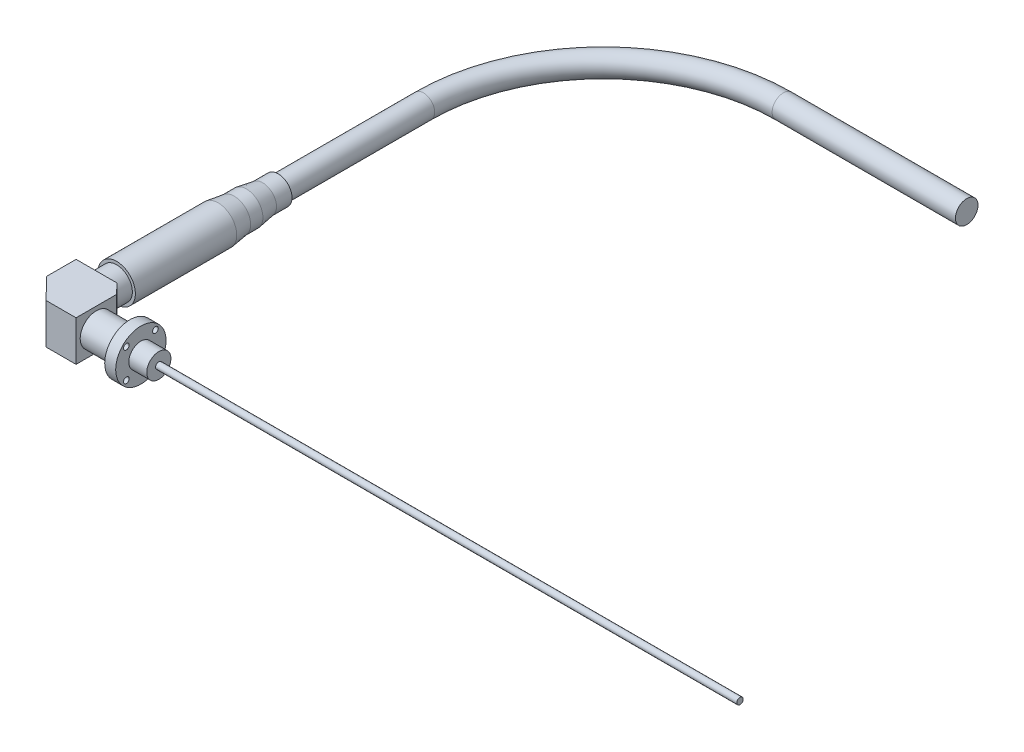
ISO-10303-21;
HEADER;
FILE_DESCRIPTION(('STEP AP214'),'2;1');
FILE_NAME('part.step','',(''),(''),'','','');
FILE_SCHEMA(('AUTOMOTIVE_DESIGN { 1 0 10303 214 1 1 1 1 }'));
ENDSEC;
DATA;
#1=APPLICATION_CONTEXT('core data for automotive mechanical design processes');
#2=APPLICATION_PROTOCOL_DEFINITION('international standard','automotive_design',2000,#1);
#3=PRODUCT_CONTEXT('',#1,'mechanical');
#4=PRODUCT('Part','Part','',(#3));
#5=PRODUCT_RELATED_PRODUCT_CATEGORY('part','',(#4));
#6=PRODUCT_DEFINITION_FORMATION('','',#4);
#7=PRODUCT_DEFINITION_CONTEXT('part definition',#1,'design');
#8=PRODUCT_DEFINITION('design','',#6,#7);
#9=PRODUCT_DEFINITION_SHAPE('','',#8);
#10=(LENGTH_UNIT() NAMED_UNIT(*) SI_UNIT(.MILLI.,.METRE.));
#11=(NAMED_UNIT(*) PLANE_ANGLE_UNIT() SI_UNIT($,.RADIAN.));
#12=(NAMED_UNIT(*) SI_UNIT($,.STERADIAN.) SOLID_ANGLE_UNIT());
#13=UNCERTAINTY_MEASURE_WITH_UNIT(LENGTH_MEASURE(1.E-05),#10,'distance_accuracy_value','');
#14=(GEOMETRIC_REPRESENTATION_CONTEXT(3) GLOBAL_UNCERTAINTY_ASSIGNED_CONTEXT((#13)) GLOBAL_UNIT_ASSIGNED_CONTEXT((#10,
#11,#12)) REPRESENTATION_CONTEXT('',''));
#15=CARTESIAN_POINT('',(0.,0.,0.));
#16=DIRECTION('',(0.,0.,1.));
#17=DIRECTION('',(1.,0.,0.));
#18=AXIS2_PLACEMENT_3D('',#15,#16,#17);
#19=CARTESIAN_POINT('',(72.7964,0.,23.876));
#20=DIRECTION('',(-1.,0.,0.));
#21=DIRECTION('',(0.,0.,1.));
#22=AXIS2_PLACEMENT_3D('',#19,#20,#21);
#23=PLANE('',#22);
#24=CARTESIAN_POINT('',(72.7964,0.,23.876));
#25=DIRECTION('',(-1.,0.,0.));
#26=DIRECTION('',(0.,0.,1.));
#27=AXIS2_PLACEMENT_3D('',#24,#25,#26);
#28=CIRCLE('',#27,9.4996);
#29=CARTESIAN_POINT('',(72.7964,0.,33.3756));
#30=VERTEX_POINT('',#29);
#31=EDGE_CURVE('E457',#30,#30,#28,.T.);
#32=ORIENTED_EDGE('',*,*,#31,.F.);
#33=EDGE_LOOP('',(#32));
#34=FACE_BOUND('',#33,.T.);
#35=CARTESIAN_POINT('',(72.7964,0.,23.876));
#36=DIRECTION('',(-1.,0.,0.));
#37=DIRECTION('',(0.,0.,1.));
#38=AXIS2_PLACEMENT_3D('',#35,#36,#37);
#39=CIRCLE('',#38,2.54);
#40=CARTESIAN_POINT('',(72.7964,0.,26.416));
#41=VERTEX_POINT('',#40);
#42=EDGE_CURVE('E11',#41,#41,#39,.F.);
#43=ORIENTED_EDGE('',*,*,#42,.F.);
#44=EDGE_LOOP('',(#43));
#45=FACE_BOUND('',#44,.T.);
#46=ADVANCED_FACE('F380',(#34,#45),#23,.F.);
#47=CARTESIAN_POINT('',(23.6455461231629,15.875,7.97842349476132));
#48=DIRECTION('',(-1.,0.,0.));
#49=DIRECTION('',(0.,0.,1.));
#50=AXIS2_PLACEMENT_3D('',#47,#48,#49);
#51=PLANE('',#50);
#52=DIRECTION('',(0.,0.,-1.));
#53=VECTOR('',#52,1.);
#54=CARTESIAN_POINT('',(23.6455461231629,-15.875,7.97842349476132));
#55=LINE('',#54,#53);
#56=CARTESIAN_POINT('',(23.6455461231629,-15.875,39.8332355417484));
#57=VERTEX_POINT('',#56);
#58=CARTESIAN_POINT('',(23.6455461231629,-15.875,7.97842349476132));
#59=VERTEX_POINT('',#58);
#60=EDGE_CURVE('E465',#57,#59,#55,.T.);
#61=ORIENTED_EDGE('',*,*,#60,.T.);
#62=DIRECTION('',(0.,-1.,0.));
#63=VECTOR('',#62,1.);
#64=CARTESIAN_POINT('',(23.6455461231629,15.875,7.97842349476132));
#65=LINE('',#64,#63);
#66=CARTESIAN_POINT('',(23.6455461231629,15.875,7.97842349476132));
#67=VERTEX_POINT('',#66);
#68=EDGE_CURVE('E484',#67,#59,#65,.T.);
#69=ORIENTED_EDGE('',*,*,#68,.F.);
#70=DIRECTION('',(0.,0.,-1.));
#71=VECTOR('',#70,1.);
#72=CARTESIAN_POINT('',(23.6455461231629,15.875,7.97842349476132));
#73=LINE('',#72,#71);
#74=CARTESIAN_POINT('',(23.6455461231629,15.875,39.8332355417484));
#75=VERTEX_POINT('',#74);
#76=EDGE_CURVE('E476',#75,#67,#73,.T.);
#77=ORIENTED_EDGE('',*,*,#76,.F.);
#78=DIRECTION('',(0.,-1.,0.));
#79=VECTOR('',#78,1.);
#80=CARTESIAN_POINT('',(23.6455461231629,15.875,39.8332355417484));
#81=LINE('',#80,#79);
#82=EDGE_CURVE('E487',#75,#57,#81,.T.);
#83=ORIENTED_EDGE('',*,*,#82,.T.);
#84=EDGE_LOOP('',(#61,#69,#77,#83));
#85=FACE_BOUND('',#84,.T.);
#86=CARTESIAN_POINT('',(23.6455461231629,0.,23.876));
#87=DIRECTION('',(-1.,0.,0.));
#88=DIRECTION('',(0.,0.,1.));
#89=AXIS2_PLACEMENT_3D('',#86,#87,#88);
#90=CIRCLE('',#89,12.7);
#91=CARTESIAN_POINT('',(23.6455461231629,0.,36.576));
#92=VERTEX_POINT('',#91);
#93=EDGE_CURVE('E388',#92,#92,#90,.F.);
#94=ORIENTED_EDGE('',*,*,#93,.F.);
#95=EDGE_LOOP('',(#94));
#96=FACE_BOUND('',#95,.T.);
#97=ADVANCED_FACE('F530',(#85,#96),#51,.F.);
#98=CARTESIAN_POINT('',(0.,0.,-204.828193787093));
#99=DIRECTION('',(0.,0.,-1.));
#100=DIRECTION('',(-1.,0.,0.));
#101=AXIS2_PLACEMENT_3D('',#98,#99,#100);
#102=CYLINDRICAL_SURFACE('',#101,12.3825);
#103=CARTESIAN_POINT('',(0.,0.,0.));
#104=DIRECTION('',(0.,0.,1.));
#105=DIRECTION('',(1.,0.,0.));
#106=AXIS2_PLACEMENT_3D('',#103,#104,#105);
#107=CIRCLE('',#106,12.3825);
#108=CARTESIAN_POINT('',(12.3825,0.,0.));
#109=VERTEX_POINT('',#108);
#110=EDGE_CURVE('E451',#109,#109,#107,.F.);
#111=ORIENTED_EDGE('',*,*,#110,.T.);
#112=EDGE_LOOP('',(#111));
#113=FACE_BOUND('',#112,.T.);
#114=CARTESIAN_POINT('',(0.,0.,-15.748));
#115=DIRECTION('',(0.,0.,-1.));
#116=DIRECTION('',(-1.,0.,0.));
#117=AXIS2_PLACEMENT_3D('',#114,#115,#116);
#118=CIRCLE('',#117,12.3825);
#119=CARTESIAN_POINT('',(-12.3825,0.,-15.748));
#120=VERTEX_POINT('',#119);
#121=EDGE_CURVE('E497',#120,#120,#118,.T.);
#122=ORIENTED_EDGE('',*,*,#121,.F.);
#123=EDGE_LOOP('',(#122));
#124=FACE_BOUND('',#123,.T.);
#125=ADVANCED_FACE('F382',(#113,#124),#102,.T.);
#126=CARTESIAN_POINT('',(-14.732,0.,-15.748));
#127=DIRECTION('',(0.,0.,1.));
#128=DIRECTION('',(1.,0.,0.));
#129=AXIS2_PLACEMENT_3D('',#126,#127,#128);
#130=PLANE('',#129);
#131=ORIENTED_EDGE('',*,*,#121,.T.);
#132=EDGE_LOOP('',(#131));
#133=FACE_BOUND('',#132,.T.);
#134=CARTESIAN_POINT('',(0.,0.,-15.748));
#135=DIRECTION('',(0.,0.,-1.));
#136=DIRECTION('',(-1.,0.,0.));
#137=AXIS2_PLACEMENT_3D('',#134,#135,#136);
#138=CIRCLE('',#137,14.732);
#139=CARTESIAN_POINT('',(-14.732,0.,-15.748));
#140=VERTEX_POINT('',#139);
#141=EDGE_CURVE('E521',#140,#140,#138,.T.);
#142=ORIENTED_EDGE('',*,*,#141,.F.);
#143=EDGE_LOOP('',(#142));
#144=FACE_BOUND('',#143,.T.);
#145=ADVANCED_FACE('F539',(#133,#144),#130,.T.);
#146=CARTESIAN_POINT('',(0.,0.,-204.828193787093));
#147=DIRECTION('',(0.,0.,-1.));
#148=DIRECTION('',(-1.,0.,0.));
#149=AXIS2_PLACEMENT_3D('',#146,#147,#148);
#150=CYLINDRICAL_SURFACE('',#149,14.732);
#151=ORIENTED_EDGE('',*,*,#141,.T.);
#152=EDGE_LOOP('',(#151));
#153=FACE_BOUND('',#152,.T.);
#154=CARTESIAN_POINT('',(0.,0.,-95.504));
#155=DIRECTION('',(0.,0.,-1.));
#156=DIRECTION('',(-1.,0.,0.));
#157=AXIS2_PLACEMENT_3D('',#154,#155,#156);
#158=CIRCLE('',#157,14.732);
#159=CARTESIAN_POINT('',(-14.732,0.,-95.504));
#160=VERTEX_POINT('',#159);
#161=EDGE_CURVE('E518',#160,#160,#158,.T.);
#162=ORIENTED_EDGE('',*,*,#161,.F.);
#163=EDGE_LOOP('',(#162));
#164=FACE_BOUND('',#163,.T.);
#165=ADVANCED_FACE('F589',(#153,#164),#150,.T.);
#166=CARTESIAN_POINT('',(0.,0.,-108.204));
#167=DIRECTION('',(0.,0.,1.));
#168=DIRECTION('',(1.,0.,0.));
#169=AXIS2_PLACEMENT_3D('',#166,#167,#168);
#170=CONICAL_SURFACE('',#169,12.954,0.13909594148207);
#171=ORIENTED_EDGE('',*,*,#161,.T.);
#172=EDGE_LOOP('',(#171));
#173=FACE_BOUND('',#172,.T.);
#174=CARTESIAN_POINT('',(0.,0.,-108.204));
#175=DIRECTION('',(0.,0.,-1.));
#176=DIRECTION('',(-1.,0.,0.));
#177=AXIS2_PLACEMENT_3D('',#174,#175,#176);
#178=CIRCLE('',#177,12.954);
#179=CARTESIAN_POINT('',(-12.954,0.,-108.204));
#180=VERTEX_POINT('',#179);
#181=EDGE_CURVE('E515',#180,#180,#178,.T.);
#182=ORIENTED_EDGE('',*,*,#181,.F.);
#183=EDGE_LOOP('',(#182));
#184=FACE_BOUND('',#183,.T.);
#185=ADVANCED_FACE('F585',(#173,#184),#170,.T.);
#186=CARTESIAN_POINT('',(0.,0.,-204.828193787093));
#187=DIRECTION('',(0.,0.,-1.));
#188=DIRECTION('',(-1.,0.,0.));
#189=AXIS2_PLACEMENT_3D('',#186,#187,#188);
#190=CYLINDRICAL_SURFACE('',#189,12.954);
#191=ORIENTED_EDGE('',*,*,#181,.T.);
#192=EDGE_LOOP('',(#191));
#193=FACE_BOUND('',#192,.T.);
#194=CARTESIAN_POINT('',(0.,0.,-117.856));
#195=DIRECTION('',(0.,0.,-1.));
#196=DIRECTION('',(-1.,0.,0.));
#197=AXIS2_PLACEMENT_3D('',#194,#195,#196);
#198=CIRCLE('',#197,12.954);
#199=CARTESIAN_POINT('',(-12.954,0.,-117.856));
#200=VERTEX_POINT('',#199);
#201=EDGE_CURVE('E512',#200,#200,#198,.T.);
#202=ORIENTED_EDGE('',*,*,#201,.F.);
#203=EDGE_LOOP('',(#202));
#204=FACE_BOUND('',#203,.T.);
#205=ADVANCED_FACE('F581',(#193,#204),#190,.T.);
#206=CARTESIAN_POINT('',(0.,0.,-130.556));
#207=DIRECTION('',(0.,0.,1.));
#208=DIRECTION('',(1.,0.,0.));
#209=AXIS2_PLACEMENT_3D('',#206,#207,#208);
#210=CONICAL_SURFACE('',#209,10.922,0.1586552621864);
#211=ORIENTED_EDGE('',*,*,#201,.T.);
#212=EDGE_LOOP('',(#211));
#213=FACE_BOUND('',#212,.T.);
#214=CARTESIAN_POINT('',(0.,0.,-130.556));
#215=DIRECTION('',(0.,0.,-1.));
#216=DIRECTION('',(-1.,0.,0.));
#217=AXIS2_PLACEMENT_3D('',#214,#215,#216);
#218=CIRCLE('',#217,10.922);
#219=CARTESIAN_POINT('',(-10.922,0.,-130.556));
#220=VERTEX_POINT('',#219);
#221=EDGE_CURVE('E509',#220,#220,#218,.T.);
#222=ORIENTED_EDGE('',*,*,#221,.F.);
#223=EDGE_LOOP('',(#222));
#224=FACE_BOUND('',#223,.T.);
#225=ADVANCED_FACE('F577',(#213,#224),#210,.T.);
#226=CARTESIAN_POINT('',(0.,0.,-204.828193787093));
#227=DIRECTION('',(0.,0.,-1.));
#228=DIRECTION('',(-1.,0.,0.));
#229=AXIS2_PLACEMENT_3D('',#226,#227,#228);
#230=CYLINDRICAL_SURFACE('',#229,10.922);
#231=ORIENTED_EDGE('',*,*,#221,.T.);
#232=EDGE_LOOP('',(#231));
#233=FACE_BOUND('',#232,.T.);
#234=CARTESIAN_POINT('',(0.,0.,-142.748));
#235=DIRECTION('',(0.,0.,-1.));
#236=DIRECTION('',(-1.,0.,0.));
#237=AXIS2_PLACEMENT_3D('',#234,#235,#236);
#238=CIRCLE('',#237,10.922);
#239=CARTESIAN_POINT('',(-10.922,0.,-142.748));
#240=VERTEX_POINT('',#239);
#241=EDGE_CURVE('E506',#240,#240,#238,.T.);
#242=ORIENTED_EDGE('',*,*,#241,.F.);
#243=EDGE_LOOP('',(#242));
#244=FACE_BOUND('',#243,.T.);
#245=ADVANCED_FACE('F573',(#233,#244),#230,.T.);
#246=CARTESIAN_POINT('',(-10.922,0.,-142.748));
#247=DIRECTION('',(0.,0.,-1.));
#248=DIRECTION('',(-1.,0.,0.));
#249=AXIS2_PLACEMENT_3D('',#246,#247,#248);
#250=PLANE('',#249);
#251=CARTESIAN_POINT('',(0.,0.,-142.748));
#252=DIRECTION('',(0.,0.,-1.));
#253=DIRECTION('',(-1.,0.,0.));
#254=AXIS2_PLACEMENT_3D('',#251,#252,#253);
#255=CIRCLE('',#254,8.89);
#256=CARTESIAN_POINT('',(-8.89000000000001,0.,-142.748));
#257=VERTEX_POINT('',#256);
#258=EDGE_CURVE('E494',#257,#257,#255,.T.);
#259=ORIENTED_EDGE('',*,*,#258,.F.);
#260=EDGE_LOOP('',(#259));
#261=FACE_BOUND('',#260,.T.);
#262=ORIENTED_EDGE('',*,*,#241,.T.);
#263=EDGE_LOOP('',(#262));
#264=FACE_BOUND('',#263,.T.);
#265=ADVANCED_FACE('F569',(#261,#264),#250,.T.);
#266=CARTESIAN_POINT('',(141.605,0.,-398.653));
#267=DIRECTION('',(1.,0.,0.));
#268=DIRECTION('',(0.,0.,-1.));
#269=AXIS2_PLACEMENT_3D('',#266,#267,#268);
#270=CYLINDRICAL_SURFACE('',#269,8.89);
#271=CARTESIAN_POINT('',(141.605,0.,-398.653));
#272=DIRECTION('',(1.,0.,0.));
#273=DIRECTION('',(0.,0.,-1.));
#274=AXIS2_PLACEMENT_3D('',#271,#272,#273);
#275=CIRCLE('',#274,8.89);
#276=CARTESIAN_POINT('',(141.605,0.,-407.543));
#277=VERTEX_POINT('',#276);
#278=EDGE_CURVE('E500',#277,#277,#275,.T.);
#279=ORIENTED_EDGE('',*,*,#278,.T.);
#280=EDGE_LOOP('',(#279));
#281=FACE_BOUND('',#280,.T.);
#282=CARTESIAN_POINT('',(285.787998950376,0.,-398.653));
#283=DIRECTION('',(1.,0.,0.));
#284=DIRECTION('',(0.,0.,-1.));
#285=AXIS2_PLACEMENT_3D('',#282,#283,#284);
#286=CIRCLE('',#285,8.89);
#287=CARTESIAN_POINT('',(285.787998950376,0.,-407.543));
#288=VERTEX_POINT('',#287);
#289=EDGE_CURVE('E503',#288,#288,#286,.T.);
#290=ORIENTED_EDGE('',*,*,#289,.F.);
#291=EDGE_LOOP('',(#290));
#292=FACE_BOUND('',#291,.T.);
#293=ADVANCED_FACE('F565',(#281,#292),#270,.T.);
#294=CARTESIAN_POINT('',(141.605,0.,-257.048));
#295=DIRECTION('',(0.,-1.,0.));
#296=DIRECTION('',(0.,0.,-1.));
#297=AXIS2_PLACEMENT_3D('',#294,#295,#296);
#298=TOROIDAL_SURFACE('',#297,141.605,8.89);
#299=CARTESIAN_POINT('',(0.,0.,-257.048));
#300=DIRECTION('',(0.,0.,-1.));
#301=DIRECTION('',(-1.,0.,0.));
#302=AXIS2_PLACEMENT_3D('',#299,#300,#301);
#303=CIRCLE('',#302,8.89);
#304=CARTESIAN_POINT('',(-8.89000000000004,0.,-257.048));
#305=VERTEX_POINT('',#304);
#306=EDGE_CURVE('E493',#305,#305,#303,.T.);
#307=CARTESIAN_POINT('',(141.605,0.,-257.048));
#308=DIRECTION('',(0.,-1.,0.));
#309=DIRECTION('',(0.,0.,-1.));
#310=AXIS2_PLACEMENT_3D('',#307,#308,#309);
#311=CIRCLE('',#310,150.495);
#312=EDGE_CURVE('',#305,#277,#311,.T.);
#313=ORIENTED_EDGE('',*,*,#306,.T.);
#314=ORIENTED_EDGE('',*,*,#278,.F.);
#315=ORIENTED_EDGE('',*,*,#312,.T.);
#316=ORIENTED_EDGE('',*,*,#312,.F.);
#317=EDGE_LOOP('',(#313,#315,#314,#316));
#318=FACE_BOUND('',#317,.T.);
#319=ADVANCED_FACE('F561',(#318),#298,.T.);
#320=CARTESIAN_POINT('',(0.,0.,-257.048));
#321=DIRECTION('',(0.,0.,1.));
#322=DIRECTION('',(1.,0.,0.));
#323=AXIS2_PLACEMENT_3D('',#320,#321,#322);
#324=CYLINDRICAL_SURFACE('',#323,8.89);
#325=ORIENTED_EDGE('',*,*,#306,.F.);
#326=EDGE_LOOP('',(#325));
#327=FACE_BOUND('',#326,.T.);
#328=ORIENTED_EDGE('',*,*,#258,.T.);
#329=EDGE_LOOP('',(#328));
#330=FACE_BOUND('',#329,.T.);
#331=ADVANCED_FACE('F557',(#327,#330),#324,.T.);
#332=CARTESIAN_POINT('',(285.787998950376,0.,-398.653));
#333=DIRECTION('',(1.,0.,0.));
#334=DIRECTION('',(0.,0.,-1.));
#335=AXIS2_PLACEMENT_3D('',#332,#333,#334);
#336=PLANE('',#335);
#337=ORIENTED_EDGE('',*,*,#289,.T.);
#338=EDGE_LOOP('',(#337));
#339=FACE_BOUND('',#338,.T.);
#340=ADVANCED_FACE('F555',(#339),#336,.T.);
#341=CARTESIAN_POINT('',(-16.172968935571,15.875,23.0932067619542));
#342=DIRECTION('',(1.,0.,0.));
#343=DIRECTION('',(0.,0.,-1.));
#344=AXIS2_PLACEMENT_3D('',#341,#342,#343);
#345=PLANE('',#344);
#346=DIRECTION('',(0.,0.,1.));
#347=VECTOR('',#346,1.);
#348=CARTESIAN_POINT('',(-16.172968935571,-15.875,23.0932067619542));
#349=LINE('',#348,#347);
#350=CARTESIAN_POINT('',(-16.172968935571,-15.875,0.));
#351=VERTEX_POINT('',#350);
#352=CARTESIAN_POINT('',(-16.172968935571,-15.875,23.0932067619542));
#353=VERTEX_POINT('',#352);
#354=EDGE_CURVE('E438',#351,#353,#349,.T.);
#355=ORIENTED_EDGE('',*,*,#354,.T.);
#356=DIRECTION('',(0.,-1.,0.));
#357=VECTOR('',#356,1.);
#358=CARTESIAN_POINT('',(-16.172968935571,15.875,23.0932067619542));
#359=LINE('',#358,#357);
#360=CARTESIAN_POINT('',(-16.172968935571,15.875,23.0932067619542));
#361=VERTEX_POINT('',#360);
#362=EDGE_CURVE('E446',#361,#353,#359,.T.);
#363=ORIENTED_EDGE('',*,*,#362,.F.);
#364=DIRECTION('',(0.,0.,1.));
#365=VECTOR('',#364,1.);
#366=CARTESIAN_POINT('',(-16.172968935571,15.875,23.0932067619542));
#367=LINE('',#366,#365);
#368=CARTESIAN_POINT('',(-16.172968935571,15.875,0.));
#369=VERTEX_POINT('',#368);
#370=EDGE_CURVE('E471',#369,#361,#367,.T.);
#371=ORIENTED_EDGE('',*,*,#370,.F.);
#372=DIRECTION('',(0.,-1.,0.));
#373=VECTOR('',#372,1.);
#374=CARTESIAN_POINT('',(-16.172968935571,15.875,0.));
#375=LINE('',#374,#373);
#376=EDGE_CURVE('E456',#369,#351,#375,.T.);
#377=ORIENTED_EDGE('',*,*,#376,.T.);
#378=EDGE_LOOP('',(#355,#363,#371,#377));
#379=FACE_BOUND('',#378,.T.);
#380=ADVANCED_FACE('F455',(#379),#345,.F.);
#381=CARTESIAN_POINT('',(0.,15.875,39.8332355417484));
#382=DIRECTION('',(0.719182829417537,0.,-0.694820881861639));
#383=DIRECTION('',(-0.694820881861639,0.,-0.719182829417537));
#384=AXIS2_PLACEMENT_3D('',#381,#382,#383);
#385=PLANE('',#384);
#386=DIRECTION('',(0.694820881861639,0.,0.719182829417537));
#387=VECTOR('',#386,1.);
#388=CARTESIAN_POINT('',(0.,-15.875,39.8332355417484));
#389=LINE('',#388,#387);
#390=CARTESIAN_POINT('',(0.,-15.875,39.8332355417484));
#391=VERTEX_POINT('',#390);
#392=EDGE_CURVE('E433',#353,#391,#389,.T.);
#393=ORIENTED_EDGE('',*,*,#392,.T.);
#394=DIRECTION('',(0.,-1.,0.));
#395=VECTOR('',#394,1.);
#396=CARTESIAN_POINT('',(0.,15.875,39.8332355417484));
#397=LINE('',#396,#395);
#398=CARTESIAN_POINT('',(0.,15.875,39.8332355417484));
#399=VERTEX_POINT('',#398);
#400=EDGE_CURVE('E452',#399,#391,#397,.T.);
#401=ORIENTED_EDGE('',*,*,#400,.F.);
#402=DIRECTION('',(0.694820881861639,0.,0.719182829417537));
#403=VECTOR('',#402,1.);
#404=CARTESIAN_POINT('',(0.,15.875,39.8332355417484));
#405=LINE('',#404,#403);
#406=EDGE_CURVE('E448',#361,#399,#405,.T.);
#407=ORIENTED_EDGE('',*,*,#406,.F.);
#408=ORIENTED_EDGE('',*,*,#362,.T.);
#409=EDGE_LOOP('',(#393,#401,#407,#408));
#410=FACE_BOUND('',#409,.T.);
#411=ADVANCED_FACE('F447',(#410),#385,.F.);
#412=CARTESIAN_POINT('',(23.6455461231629,15.875,39.8332355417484));
#413=DIRECTION('',(0.,0.,-1.));
#414=DIRECTION('',(-1.,0.,0.));
#415=AXIS2_PLACEMENT_3D('',#412,#413,#414);
#416=PLANE('',#415);
#417=DIRECTION('',(1.,0.,0.));
#418=VECTOR('',#417,1.);
#419=CARTESIAN_POINT('',(23.6455461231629,-15.875,39.8332355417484));
#420=LINE('',#419,#418);
#421=EDGE_CURVE('E440',#391,#57,#420,.T.);
#422=ORIENTED_EDGE('',*,*,#421,.T.);
#423=ORIENTED_EDGE('',*,*,#82,.F.);
#424=DIRECTION('',(1.,0.,0.));
#425=VECTOR('',#424,1.);
#426=CARTESIAN_POINT('',(23.6455461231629,15.875,39.8332355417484));
#427=LINE('',#426,#425);
#428=EDGE_CURVE('E474',#399,#75,#427,.T.);
#429=ORIENTED_EDGE('',*,*,#428,.F.);
#430=ORIENTED_EDGE('',*,*,#400,.T.);
#431=EDGE_LOOP('',(#422,#423,#429,#430));
#432=FACE_BOUND('',#431,.T.);
#433=ADVANCED_FACE('F548',(#432),#416,.F.);
#434=CARTESIAN_POINT('',(16.0068922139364,15.875,0.));
#435=DIRECTION('',(-0.722319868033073,0.,0.691559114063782));
#436=DIRECTION('',(0.691559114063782,0.,0.722319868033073));
#437=AXIS2_PLACEMENT_3D('',#434,#435,#436);
#438=PLANE('',#437);
#439=DIRECTION('',(-0.691559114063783,0.,-0.722319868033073));
#440=VECTOR('',#439,1.);
#441=CARTESIAN_POINT('',(16.0068922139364,-15.875,0.));
#442=LINE('',#441,#440);
#443=CARTESIAN_POINT('',(16.0068922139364,-15.875,0.));
#444=VERTEX_POINT('',#443);
#445=EDGE_CURVE('E467',#59,#444,#442,.T.);
#446=ORIENTED_EDGE('',*,*,#445,.T.);
#447=DIRECTION('',(0.,-1.,0.));
#448=VECTOR('',#447,1.);
#449=CARTESIAN_POINT('',(16.0068922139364,15.875,0.));
#450=LINE('',#449,#448);
#451=CARTESIAN_POINT('',(16.0068922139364,15.875,0.));
#452=VERTEX_POINT('',#451);
#453=EDGE_CURVE('E481',#452,#444,#450,.T.);
#454=ORIENTED_EDGE('',*,*,#453,.F.);
#455=DIRECTION('',(-0.691559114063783,0.,-0.722319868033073));
#456=VECTOR('',#455,1.);
#457=CARTESIAN_POINT('',(16.0068922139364,15.875,0.));
#458=LINE('',#457,#456);
#459=EDGE_CURVE('E400',#67,#452,#458,.T.);
#460=ORIENTED_EDGE('',*,*,#459,.F.);
#461=ORIENTED_EDGE('',*,*,#68,.T.);
#462=EDGE_LOOP('',(#446,#454,#460,#461));
#463=FACE_BOUND('',#462,.T.);
#464=ADVANCED_FACE('F546',(#463),#438,.F.);
#465=CARTESIAN_POINT('',(-16.172968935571,15.875,0.));
#466=DIRECTION('',(0.,0.,1.));
#467=DIRECTION('',(1.,0.,0.));
#468=AXIS2_PLACEMENT_3D('',#465,#466,#467);
#469=PLANE('',#468);
#470=ORIENTED_EDGE('',*,*,#110,.F.);
#471=EDGE_LOOP('',(#470));
#472=FACE_BOUND('',#471,.T.);
#473=DIRECTION('',(-1.,0.,0.));
#474=VECTOR('',#473,1.);
#475=CARTESIAN_POINT('',(-16.172968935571,-15.875,0.));
#476=LINE('',#475,#474);
#477=EDGE_CURVE('E469',#444,#351,#476,.T.);
#478=ORIENTED_EDGE('',*,*,#477,.T.);
#479=ORIENTED_EDGE('',*,*,#376,.F.);
#480=DIRECTION('',(-1.,0.,0.));
#481=VECTOR('',#480,1.);
#482=CARTESIAN_POINT('',(-16.172968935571,15.875,0.));
#483=LINE('',#482,#481);
#484=EDGE_CURVE('E395',#452,#369,#483,.T.);
#485=ORIENTED_EDGE('',*,*,#484,.F.);
#486=ORIENTED_EDGE('',*,*,#453,.T.);
#487=EDGE_LOOP('',(#478,#479,#485,#486));
#488=FACE_BOUND('',#487,.T.);
#489=ADVANCED_FACE('F718',(#472,#488),#469,.F.);
#490=CARTESIAN_POINT('',(-16.172968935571,15.875,0.));
#491=DIRECTION('',(0.,-1.,0.));
#492=DIRECTION('',(0.,0.,-1.));
#493=AXIS2_PLACEMENT_3D('',#490,#491,#492);
#494=PLANE('',#493);
#495=ORIENTED_EDGE('',*,*,#370,.T.);
#496=ORIENTED_EDGE('',*,*,#406,.T.);
#497=ORIENTED_EDGE('',*,*,#428,.T.);
#498=ORIENTED_EDGE('',*,*,#76,.T.);
#499=ORIENTED_EDGE('',*,*,#459,.T.);
#500=ORIENTED_EDGE('',*,*,#484,.T.);
#501=EDGE_LOOP('',(#495,#496,#497,#498,#499,#500));
#502=FACE_BOUND('',#501,.T.);
#503=ADVANCED_FACE('F725',(#502),#494,.F.);
#504=CARTESIAN_POINT('',(-16.172968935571,-15.875,0.));
#505=DIRECTION('',(0.,-1.,0.));
#506=DIRECTION('',(0.,0.,-1.));
#507=AXIS2_PLACEMENT_3D('',#504,#505,#506);
#508=PLANE('',#507);
#509=ORIENTED_EDGE('',*,*,#354,.F.);
#510=ORIENTED_EDGE('',*,*,#477,.F.);
#511=ORIENTED_EDGE('',*,*,#445,.F.);
#512=ORIENTED_EDGE('',*,*,#60,.F.);
#513=ORIENTED_EDGE('',*,*,#421,.F.);
#514=ORIENTED_EDGE('',*,*,#392,.F.);
#515=EDGE_LOOP('',(#509,#510,#511,#512,#513,#514));
#516=FACE_BOUND('',#515,.T.);
#517=ADVANCED_FACE('F435',(#516),#508,.T.);
#518=CARTESIAN_POINT('',(0.,0.,23.876));
#519=DIRECTION('',(-1.,0.,0.));
#520=DIRECTION('',(0.,0.,1.));
#521=AXIS2_PLACEMENT_3D('',#518,#519,#520);
#522=CYLINDRICAL_SURFACE('',#521,12.7);
#523=CARTESIAN_POINT('',(50.038,0.,23.876));
#524=DIRECTION('',(-1.,0.,0.));
#525=DIRECTION('',(0.,0.,1.));
#526=AXIS2_PLACEMENT_3D('',#523,#524,#525);
#527=CIRCLE('',#526,12.7);
#528=CARTESIAN_POINT('',(50.038,0.,36.576));
#529=VERTEX_POINT('',#528);
#530=EDGE_CURVE('E818',#529,#529,#527,.T.);
#531=ORIENTED_EDGE('',*,*,#530,.T.);
#532=EDGE_LOOP('',(#531));
#533=FACE_BOUND('',#532,.T.);
#534=ORIENTED_EDGE('',*,*,#93,.T.);
#535=EDGE_LOOP('',(#534));
#536=FACE_BOUND('',#535,.T.);
#537=ADVANCED_FACE('F528',(#533,#536),#522,.T.);
#538=CARTESIAN_POINT('',(0.,0.,23.876));
#539=DIRECTION('',(-1.,0.,0.));
#540=DIRECTION('',(0.,0.,1.));
#541=AXIS2_PLACEMENT_3D('',#538,#539,#540);
#542=CYLINDRICAL_SURFACE('',#541,9.4996);
#543=CARTESIAN_POINT('',(58.674,0.,23.876));
#544=DIRECTION('',(-1.,0.,0.));
#545=DIRECTION('',(0.,0.,1.));
#546=AXIS2_PLACEMENT_3D('',#543,#544,#545);
#547=CIRCLE('',#546,9.4996);
#548=CARTESIAN_POINT('',(58.674,0.,33.3756));
#549=VERTEX_POINT('',#548);
#550=EDGE_CURVE('E460',#549,#549,#547,.T.);
#551=ORIENTED_EDGE('',*,*,#550,.F.);
#552=EDGE_LOOP('',(#551));
#553=FACE_BOUND('',#552,.T.);
#554=ORIENTED_EDGE('',*,*,#31,.T.);
#555=EDGE_LOOP('',(#554));
#556=FACE_BOUND('',#555,.T.);
#557=ADVANCED_FACE('F661',(#553,#556),#542,.T.);
#558=CARTESIAN_POINT('',(58.674,0.,14.3764));
#559=DIRECTION('',(-1.,0.,0.));
#560=DIRECTION('',(0.,0.,1.));
#561=AXIS2_PLACEMENT_3D('',#558,#559,#560);
#562=PLANE('',#561);
#563=CARTESIAN_POINT('',(58.674,-11.4408462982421,12.4351537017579));
#564=DIRECTION('',(1.,0.,0.));
#565=DIRECTION('',(0.,0.,-1.));
#566=AXIS2_PLACEMENT_3D('',#563,#564,#565);
#567=CIRCLE('',#566,2.2479);
#568=CARTESIAN_POINT('',(58.674,-11.4408462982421,10.1872537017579));
#569=VERTEX_POINT('',#568);
#570=EDGE_CURVE('E790',#569,#569,#567,.T.);
#571=ORIENTED_EDGE('',*,*,#570,.F.);
#572=EDGE_LOOP('',(#571));
#573=FACE_BOUND('',#572,.T.);
#574=CARTESIAN_POINT('',(58.674,11.4408462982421,12.4351537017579));
#575=DIRECTION('',(1.,0.,0.));
#576=DIRECTION('',(0.,0.,-1.));
#577=AXIS2_PLACEMENT_3D('',#574,#575,#576);
#578=CIRCLE('',#577,2.2479);
#579=CARTESIAN_POINT('',(58.674,11.4408462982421,10.1872537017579));
#580=VERTEX_POINT('',#579);
#581=EDGE_CURVE('E800',#580,#580,#578,.T.);
#582=ORIENTED_EDGE('',*,*,#581,.F.);
#583=EDGE_LOOP('',(#582));
#584=FACE_BOUND('',#583,.T.);
#585=CARTESIAN_POINT('',(58.674,11.4408462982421,35.3168462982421));
#586=DIRECTION('',(1.,0.,0.));
#587=DIRECTION('',(0.,0.,-1.));
#588=AXIS2_PLACEMENT_3D('',#585,#586,#587);
#589=CIRCLE('',#588,2.2479);
#590=CARTESIAN_POINT('',(58.674,11.4408462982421,33.0689462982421));
#591=VERTEX_POINT('',#590);
#592=EDGE_CURVE('E806',#591,#591,#589,.T.);
#593=ORIENTED_EDGE('',*,*,#592,.F.);
#594=EDGE_LOOP('',(#593));
#595=FACE_BOUND('',#594,.T.);
#596=CARTESIAN_POINT('',(58.674,-11.4408462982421,35.3168462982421));
#597=DIRECTION('',(1.,0.,0.));
#598=DIRECTION('',(0.,0.,-1.));
#599=AXIS2_PLACEMENT_3D('',#596,#597,#598);
#600=CIRCLE('',#599,2.2479);
#601=CARTESIAN_POINT('',(58.674,-11.4408462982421,33.0689462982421));
#602=VERTEX_POINT('',#601);
#603=EDGE_CURVE('E812',#602,#602,#600,.T.);
#604=ORIENTED_EDGE('',*,*,#603,.F.);
#605=EDGE_LOOP('',(#604));
#606=FACE_BOUND('',#605,.T.);
#607=CARTESIAN_POINT('',(58.674,0.,23.876));
#608=DIRECTION('',(-1.,0.,0.));
#609=DIRECTION('',(0.,0.,1.));
#610=AXIS2_PLACEMENT_3D('',#607,#608,#609);
#611=CIRCLE('',#610,19.812);
#612=CARTESIAN_POINT('',(58.674,0.,43.688));
#613=VERTEX_POINT('',#612);
#614=EDGE_CURVE('E824',#613,#613,#611,.T.);
#615=ORIENTED_EDGE('',*,*,#614,.F.);
#616=EDGE_LOOP('',(#615));
#617=FACE_BOUND('',#616,.T.);
#618=ORIENTED_EDGE('',*,*,#550,.T.);
#619=EDGE_LOOP('',(#618));
#620=FACE_BOUND('',#619,.T.);
#621=ADVANCED_FACE('F670',(#573,#584,#595,#606,#617,#620),#562,.F.);
#622=CARTESIAN_POINT('',(0.,0.,23.876));
#623=DIRECTION('',(-1.,0.,0.));
#624=DIRECTION('',(0.,0.,1.));
#625=AXIS2_PLACEMENT_3D('',#622,#623,#624);
#626=CYLINDRICAL_SURFACE('',#625,19.812);
#627=CARTESIAN_POINT('',(50.038,0.,23.876));
#628=DIRECTION('',(-1.,0.,0.));
#629=DIRECTION('',(0.,0.,1.));
#630=AXIS2_PLACEMENT_3D('',#627,#628,#629);
#631=CIRCLE('',#630,19.812);
#632=CARTESIAN_POINT('',(50.038,0.,43.688));
#633=VERTEX_POINT('',#632);
#634=EDGE_CURVE('E821',#633,#633,#631,.T.);
#635=ORIENTED_EDGE('',*,*,#634,.F.);
#636=EDGE_LOOP('',(#635));
#637=FACE_BOUND('',#636,.T.);
#638=ORIENTED_EDGE('',*,*,#614,.T.);
#639=EDGE_LOOP('',(#638));
#640=FACE_BOUND('',#639,.T.);
#641=ADVANCED_FACE('F679',(#637,#640),#626,.T.);
#642=CARTESIAN_POINT('',(50.038,0.,4.064));
#643=DIRECTION('',(1.,0.,0.));
#644=DIRECTION('',(0.,0.,-1.));
#645=AXIS2_PLACEMENT_3D('',#642,#643,#644);
#646=PLANE('',#645);
#647=CARTESIAN_POINT('',(50.038,-11.4408462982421,12.4351537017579));
#648=DIRECTION('',(1.,0.,0.));
#649=DIRECTION('',(0.,0.,-1.));
#650=AXIS2_PLACEMENT_3D('',#647,#648,#649);
#651=CIRCLE('',#650,2.2479);
#652=CARTESIAN_POINT('',(50.038,-11.4408462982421,10.1872537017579));
#653=VERTEX_POINT('',#652);
#654=EDGE_CURVE('E793',#653,#653,#651,.F.);
#655=ORIENTED_EDGE('',*,*,#654,.F.);
#656=EDGE_LOOP('',(#655));
#657=FACE_BOUND('',#656,.T.);
#658=CARTESIAN_POINT('',(50.038,11.4408462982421,12.4351537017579));
#659=DIRECTION('',(1.,0.,0.));
#660=DIRECTION('',(0.,0.,-1.));
#661=AXIS2_PLACEMENT_3D('',#658,#659,#660);
#662=CIRCLE('',#661,2.2479);
#663=CARTESIAN_POINT('',(50.038,11.4408462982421,10.1872537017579));
#664=VERTEX_POINT('',#663);
#665=EDGE_CURVE('E795',#664,#664,#662,.F.);
#666=ORIENTED_EDGE('',*,*,#665,.F.);
#667=EDGE_LOOP('',(#666));
#668=FACE_BOUND('',#667,.T.);
#669=CARTESIAN_POINT('',(50.038,11.4408462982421,35.3168462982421));
#670=DIRECTION('',(1.,0.,0.));
#671=DIRECTION('',(0.,0.,-1.));
#672=AXIS2_PLACEMENT_3D('',#669,#670,#671);
#673=CIRCLE('',#672,2.2479);
#674=CARTESIAN_POINT('',(50.038,11.4408462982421,33.0689462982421));
#675=VERTEX_POINT('',#674);
#676=EDGE_CURVE('E803',#675,#675,#673,.F.);
#677=ORIENTED_EDGE('',*,*,#676,.F.);
#678=EDGE_LOOP('',(#677));
#679=FACE_BOUND('',#678,.T.);
#680=CARTESIAN_POINT('',(50.038,-11.4408462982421,35.3168462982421));
#681=DIRECTION('',(1.,0.,0.));
#682=DIRECTION('',(0.,0.,-1.));
#683=AXIS2_PLACEMENT_3D('',#680,#681,#682);
#684=CIRCLE('',#683,2.2479);
#685=CARTESIAN_POINT('',(50.038,-11.4408462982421,33.0689462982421));
#686=VERTEX_POINT('',#685);
#687=EDGE_CURVE('E809',#686,#686,#684,.F.);
#688=ORIENTED_EDGE('',*,*,#687,.F.);
#689=EDGE_LOOP('',(#688));
#690=FACE_BOUND('',#689,.T.);
#691=ORIENTED_EDGE('',*,*,#530,.F.);
#692=EDGE_LOOP('',(#691));
#693=FACE_BOUND('',#692,.T.);
#694=ORIENTED_EDGE('',*,*,#634,.T.);
#695=EDGE_LOOP('',(#694));
#696=FACE_BOUND('',#695,.T.);
#697=ADVANCED_FACE('F688',(#657,#668,#679,#690,#693,#696),#646,.F.);
#698=CARTESIAN_POINT('',(529.9964,0.,23.876));
#699=DIRECTION('',(-1.,0.,0.));
#700=DIRECTION('',(0.,0.,1.));
#701=AXIS2_PLACEMENT_3D('',#698,#699,#700);
#702=CYLINDRICAL_SURFACE('',#701,2.54);
#703=CARTESIAN_POINT('',(529.9964,0.,23.876));
#704=DIRECTION('',(1.,0.,0.));
#705=DIRECTION('',(0.,0.,-1.));
#706=AXIS2_PLACEMENT_3D('',#703,#704,#705);
#707=CIRCLE('',#706,2.54);
#708=CARTESIAN_POINT('',(529.9964,0.,21.336));
#709=VERTEX_POINT('',#708);
#710=EDGE_CURVE('E815',#709,#709,#707,.T.);
#711=ORIENTED_EDGE('',*,*,#710,.F.);
#712=EDGE_LOOP('',(#711));
#713=FACE_BOUND('',#712,.T.);
#714=ORIENTED_EDGE('',*,*,#42,.T.);
#715=EDGE_LOOP('',(#714));
#716=FACE_BOUND('',#715,.T.);
#717=ADVANCED_FACE('F694',(#713,#716),#702,.T.);
#718=CARTESIAN_POINT('',(529.9964,0.,23.876));
#719=DIRECTION('',(1.,0.,0.));
#720=DIRECTION('',(0.,0.,-1.));
#721=AXIS2_PLACEMENT_3D('',#718,#719,#720);
#722=PLANE('',#721);
#723=ORIENTED_EDGE('',*,*,#710,.T.);
#724=EDGE_LOOP('',(#723));
#725=FACE_BOUND('',#724,.T.);
#726=ADVANCED_FACE('F747',(#725),#722,.T.);
#727=CARTESIAN_POINT('',(-16.173968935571,-11.4408462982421,35.3168462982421));
#728=DIRECTION('',(1.,0.,0.));
#729=DIRECTION('',(0.,0.,-1.));
#730=AXIS2_PLACEMENT_3D('',#727,#728,#729);
#731=CYLINDRICAL_SURFACE('',#730,2.2479);
#732=ORIENTED_EDGE('',*,*,#603,.T.);
#733=EDGE_LOOP('',(#732));
#734=FACE_BOUND('',#733,.T.);
#735=ORIENTED_EDGE('',*,*,#687,.T.);
#736=EDGE_LOOP('',(#735));
#737=FACE_BOUND('',#736,.T.);
#738=ADVANCED_FACE('F754',(#734,#737),#731,.F.);
#739=CARTESIAN_POINT('',(-16.173968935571,11.4408462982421,35.3168462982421));
#740=DIRECTION('',(1.,0.,0.));
#741=DIRECTION('',(0.,0.,-1.));
#742=AXIS2_PLACEMENT_3D('',#739,#740,#741);
#743=CYLINDRICAL_SURFACE('',#742,2.2479);
#744=ORIENTED_EDGE('',*,*,#592,.T.);
#745=EDGE_LOOP('',(#744));
#746=FACE_BOUND('',#745,.T.);
#747=ORIENTED_EDGE('',*,*,#676,.T.);
#748=EDGE_LOOP('',(#747));
#749=FACE_BOUND('',#748,.T.);
#750=ADVANCED_FACE('F761',(#746,#749),#743,.F.);
#751=CARTESIAN_POINT('',(-16.173968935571,11.4408462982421,12.4351537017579));
#752=DIRECTION('',(1.,0.,0.));
#753=DIRECTION('',(0.,0.,-1.));
#754=AXIS2_PLACEMENT_3D('',#751,#752,#753);
#755=CYLINDRICAL_SURFACE('',#754,2.2479);
#756=ORIENTED_EDGE('',*,*,#581,.T.);
#757=EDGE_LOOP('',(#756));
#758=FACE_BOUND('',#757,.T.);
#759=ORIENTED_EDGE('',*,*,#665,.T.);
#760=EDGE_LOOP('',(#759));
#761=FACE_BOUND('',#760,.T.);
#762=ADVANCED_FACE('F769',(#758,#761),#755,.F.);
#763=CARTESIAN_POINT('',(-16.173968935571,-11.4408462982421,12.4351537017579));
#764=DIRECTION('',(1.,0.,0.));
#765=DIRECTION('',(0.,0.,-1.));
#766=AXIS2_PLACEMENT_3D('',#763,#764,#765);
#767=CYLINDRICAL_SURFACE('',#766,2.2479);
#768=ORIENTED_EDGE('',*,*,#570,.T.);
#769=EDGE_LOOP('',(#768));
#770=FACE_BOUND('',#769,.T.);
#771=ORIENTED_EDGE('',*,*,#654,.T.);
#772=EDGE_LOOP('',(#771));
#773=FACE_BOUND('',#772,.T.);
#774=ADVANCED_FACE('F777',(#770,#773),#767,.F.);
#775=CLOSED_SHELL('',(#46,#97,#125,#145,#165,#185,#205,#225,#245,#265,#293,#319,#331,#340,#380,
#411,#433,#464,#489,#503,#517,#537,#557,#621,#641,#697,#717,#726,#738,#750,#762,#774));
#776=MANIFOLD_SOLID_BREP('B2',#775);
#777=ADVANCED_BREP_SHAPE_REPRESENTATION('',(#18,#776),#14);
#778=SHAPE_DEFINITION_REPRESENTATION(#9,#777);
ENDSEC;
END-ISO-10303-21;
